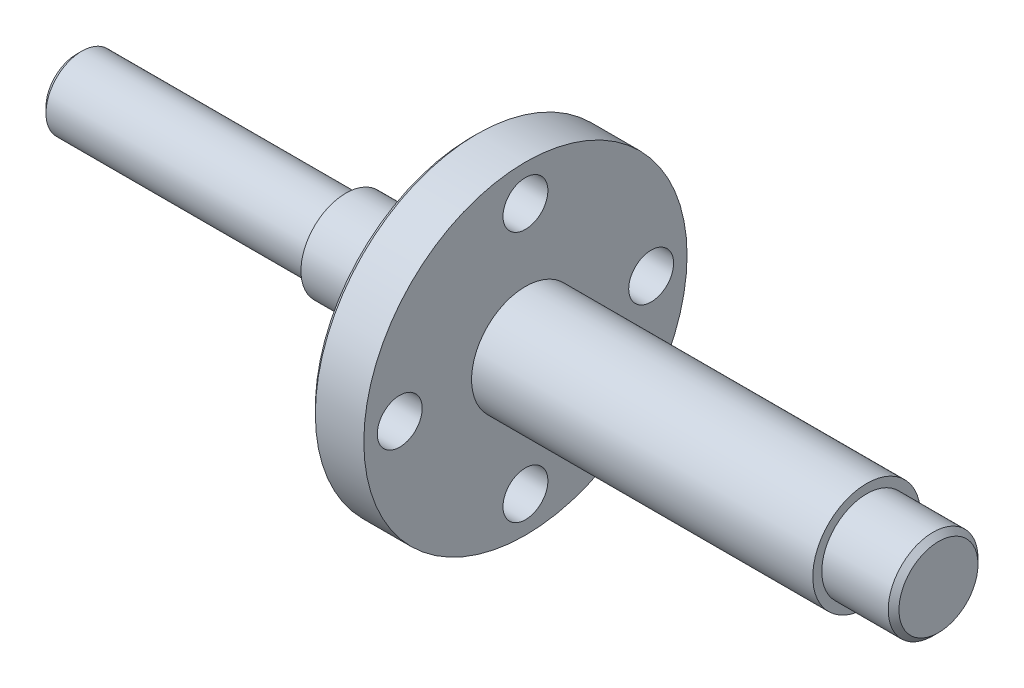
from build123d import *

# Parameters (mm, degrees)
SKETCH_1_R               = 2
EXTRUDE_1_DEPTH          = 15
SKETCH_2_R               = 2.5
EXTRUDE_2_DEPTH          = 4
SKETCH_3_R               = 3
EXTRUDE_3_DEPTH          = 3
SKETCH_4_R               = 9
EXTRUDE_4_DEPTH          = 3
SKETCH_5_R               = 3
EXTRUDE_5_DEPTH          = 19
SKETCH_8_R               = 2.5
EXTRUDE_6_DEPTH          = 4
HOLE_WIZARD_M3_2_D       = 2.5
PATTERN_CIRCULAR_2_COUNT = 4
CHAMFER_1_SIZE           = 0.3


with BuildPart() as part:
    # Sketch 1 → Extrude 1 (new body)
    with BuildSketch(Plane(origin=(0, 0, 0), x_dir=(0, 0, -1), z_dir=(1, 0, 0))):
        Circle(SKETCH_1_R)
    extrude(amount=EXTRUDE_1_DEPTH)

    # Sketch 2 → Extrude 2 (add)
    with BuildSketch(Plane(origin=(15, 0, 0), x_dir=(0, 0, -1), z_dir=(1, 0, 0))):
        Circle(SKETCH_2_R)
    extrude(amount=EXTRUDE_2_DEPTH)

    # Sketch 3 → Extrude 3 (add)
    with BuildSketch(Plane(origin=(19, 0, 0), x_dir=(0, 0, -1), z_dir=(1, 0, 0))):
        Circle(SKETCH_3_R)
    extrude(amount=EXTRUDE_3_DEPTH)

    # Sketch 4 → Extrude 4 (add)
    with BuildSketch(Plane(origin=(22, 0, 0), x_dir=(0, 0, -1), z_dir=(1, 0, 0))):
        Circle(SKETCH_4_R)
    extrude(amount=EXTRUDE_4_DEPTH)

    # Sketch 5 → Extrude 5 (add)
    with BuildSketch(Plane(origin=(25, 0, 0), x_dir=(0, 0, -1), z_dir=(1, 0, 0))):
        Circle(SKETCH_5_R)
    extrude(amount=EXTRUDE_5_DEPTH)

    # Sketch 8 → Extrude 6 (add)
    with BuildSketch(Plane(origin=(44, 0, 0), x_dir=(0, 0, -1), z_dir=(1, 0, 0))):
        Circle(SKETCH_8_R)
    extrude(amount=EXTRUDE_6_DEPTH)

    # Hole Wizard M3 _2 (through all)
    with Locations(Plane.ZY.offset(-22)):
        with Locations((0, 7)):
            hole_wizard_m3_2 = Hole(HOLE_WIZARD_M3_2_D / 2)

    # Pattern Circular 2: Hole Wizard M3 _2 ×4 about axis
    pattern_circular_2_axis = Axis((0, 0, 0), (1, 0, 0))
    for i in range(1, PATTERN_CIRCULAR_2_COUNT):
        add(hole_wizard_m3_2.rotate(pattern_circular_2_axis, i * 360 / PATTERN_CIRCULAR_2_COUNT), mode=Mode.SUBTRACT)

    # Chamfer 1
    chamfer_1_edges = [part.edges().sort_by_distance(p)[0] for p in [
        (22, 0, 9),
        (0, 0, 2),
        (48, 0, 2.5),
    ]]
    chamfer(chamfer_1_edges, length=CHAMFER_1_SIZE)


solid = part.part
